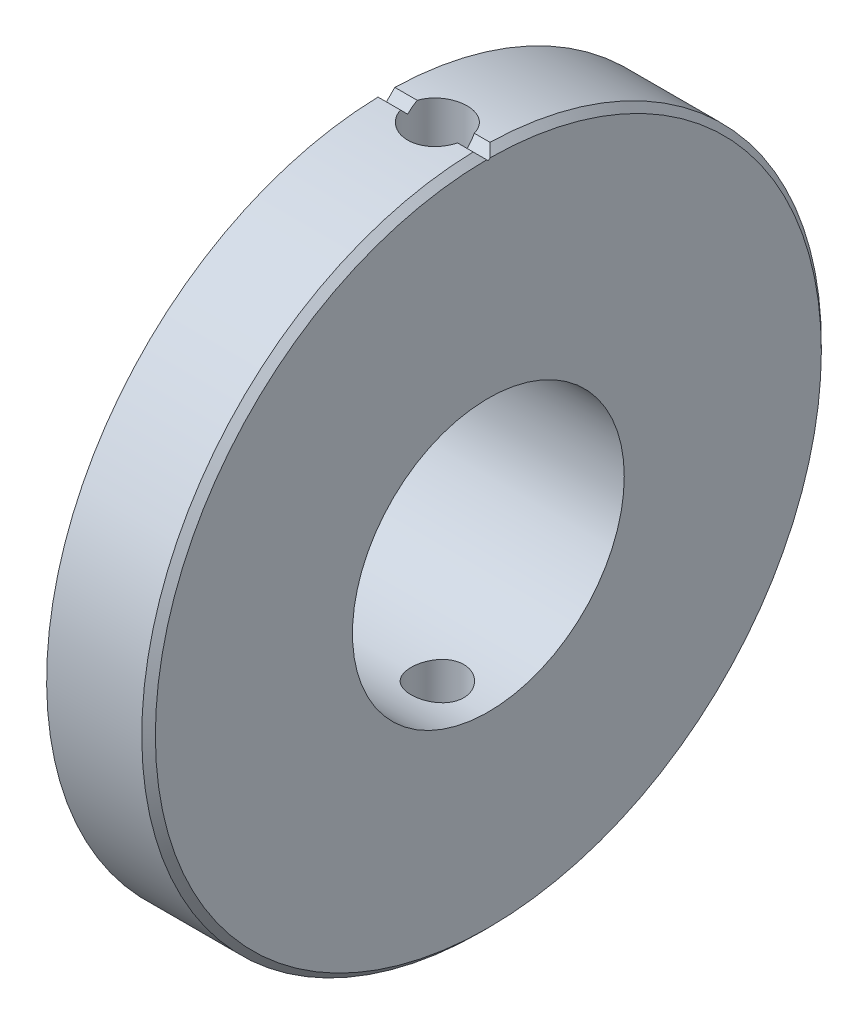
ISO-10303-21;
HEADER;
FILE_DESCRIPTION(('STEP AP214'),'2;1');
FILE_NAME('part.step','',(''),(''),'','','');
FILE_SCHEMA(('AUTOMOTIVE_DESIGN { 1 0 10303 214 1 1 1 1 }'));
ENDSEC;
DATA;
#1=APPLICATION_CONTEXT('core data for automotive mechanical design processes');
#2=APPLICATION_PROTOCOL_DEFINITION('international standard','automotive_design',2000,#1);
#3=PRODUCT_CONTEXT('',#1,'mechanical');
#4=PRODUCT('Part','Part','',(#3));
#5=PRODUCT_RELATED_PRODUCT_CATEGORY('part','',(#4));
#6=PRODUCT_DEFINITION_FORMATION('','',#4);
#7=PRODUCT_DEFINITION_CONTEXT('part definition',#1,'design');
#8=PRODUCT_DEFINITION('design','',#6,#7);
#9=PRODUCT_DEFINITION_SHAPE('','',#8);
#10=(LENGTH_UNIT() NAMED_UNIT(*) SI_UNIT(.MILLI.,.METRE.));
#11=(NAMED_UNIT(*) PLANE_ANGLE_UNIT() SI_UNIT($,.RADIAN.));
#12=(NAMED_UNIT(*) SI_UNIT($,.STERADIAN.) SOLID_ANGLE_UNIT());
#13=UNCERTAINTY_MEASURE_WITH_UNIT(LENGTH_MEASURE(1.E-05),#10,'distance_accuracy_value','');
#14=(GEOMETRIC_REPRESENTATION_CONTEXT(3) GLOBAL_UNCERTAINTY_ASSIGNED_CONTEXT((#13)) GLOBAL_UNIT_ASSIGNED_CONTEXT((#10,
#11,#12)) REPRESENTATION_CONTEXT('',''));
#15=CARTESIAN_POINT('',(0.,0.,0.));
#16=DIRECTION('',(0.,0.,1.));
#17=DIRECTION('',(1.,0.,0.));
#18=AXIS2_PLACEMENT_3D('',#15,#16,#17);
#19=CARTESIAN_POINT('',(0.,0.,0.));
#20=DIRECTION('',(-1.,0.,0.));
#21=DIRECTION('',(0.,0.,1.));
#22=AXIS2_PLACEMENT_3D('',#19,#20,#21);
#23=CYLINDRICAL_SURFACE('',#22,20.);
#24=CARTESIAN_POINT('',(7.95,-20.,0.));
#25=CARTESIAN_POINT('',(7.95000380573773,-19.9999992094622,0.0869242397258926));
#26=CARTESIAN_POINT('',(7.95733667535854,-19.9994272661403,0.173908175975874));
#27=CARTESIAN_POINT('',(7.98648181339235,-19.9972006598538,0.345470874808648));
#28=CARTESIAN_POINT('',(8.00831062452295,-19.9955447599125,0.430046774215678));
#29=CARTESIAN_POINT('',(8.06581393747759,-19.9913374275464,0.594283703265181));
#30=CARTESIAN_POINT('',(8.10148076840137,-19.9887864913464,0.673947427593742));
#31=CARTESIAN_POINT('',(8.1856343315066,-19.9830754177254,0.826137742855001));
#32=CARTESIAN_POINT('',(8.23411826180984,-19.9799154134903,0.898665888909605));
#33=CARTESIAN_POINT('',(8.34264660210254,-19.9733331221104,1.03470720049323));
#34=CARTESIAN_POINT('',(8.40271360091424,-19.9699103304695,1.09820232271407));
#35=CARTESIAN_POINT('',(8.53265551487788,-19.9631924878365,1.21422050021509));
#36=CARTESIAN_POINT('',(8.60253085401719,-19.9598974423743,1.26674308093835));
#37=CARTESIAN_POINT('',(8.75021357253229,-19.9538025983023,1.35938507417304));
#38=CARTESIAN_POINT('',(8.82803080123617,-19.9510034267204,1.39948883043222));
#39=CARTESIAN_POINT('',(8.98931959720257,-19.9462227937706,1.46605473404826));
#40=CARTESIAN_POINT('',(9.07279107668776,-19.9442413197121,1.49251709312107));
#41=CARTESIAN_POINT('',(9.24283967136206,-19.9413245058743,1.5309972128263));
#42=CARTESIAN_POINT('',(9.32941015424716,-19.9403870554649,1.54304411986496));
#43=CARTESIAN_POINT('',(9.50334913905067,-19.939657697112,1.55244139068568));
#44=CARTESIAN_POINT('',(9.59071762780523,-19.9398657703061,1.54979199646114));
#45=CARTESIAN_POINT('',(9.76357316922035,-19.9414020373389,1.5298959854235));
#46=CARTESIAN_POINT('',(9.84906388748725,-19.942727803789,1.51268100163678));
#47=CARTESIAN_POINT('',(10.0159387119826,-19.9463462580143,1.46419160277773));
#48=CARTESIAN_POINT('',(10.0973227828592,-19.9486389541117,1.43291706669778));
#49=CARTESIAN_POINT('',(10.2537751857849,-19.9539357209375,1.35716076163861));
#50=CARTESIAN_POINT('',(10.3288365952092,-19.9569405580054,1.31266475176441));
#51=CARTESIAN_POINT('',(10.4704372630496,-19.9633222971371,1.21173885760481));
#52=CARTESIAN_POINT('',(10.5369763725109,-19.9666992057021,1.15530876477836));
#53=CARTESIAN_POINT('',(10.659827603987,-19.9734553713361,1.03193889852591));
#54=CARTESIAN_POINT('',(10.7161122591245,-19.9768346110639,0.964971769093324));
#55=CARTESIAN_POINT('',(10.8166446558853,-19.9832061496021,0.822524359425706));
#56=CARTESIAN_POINT('',(10.8608923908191,-19.9861984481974,0.747044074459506));
#57=CARTESIAN_POINT('',(10.9360930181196,-19.9914594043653,0.589695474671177));
#58=CARTESIAN_POINT('',(10.9670447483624,-19.9937279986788,0.507826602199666));
#59=CARTESIAN_POINT('',(11.0147558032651,-19.9972851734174,0.340032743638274));
#60=CARTESIAN_POINT('',(11.0315153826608,-19.9985737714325,0.254107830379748));
#61=CARTESIAN_POINT('',(11.0503320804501,-20.000023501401,0.0808791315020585));
#62=CARTESIAN_POINT('',(11.0524271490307,-20.000187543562,-0.00642050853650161));
#63=CARTESIAN_POINT('',(11.0419546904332,-19.9993774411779,-0.18012983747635));
#64=CARTESIAN_POINT('',(11.0293872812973,-19.9984033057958,-0.266539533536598));
#65=CARTESIAN_POINT('',(10.9899780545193,-19.9954283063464,-0.435908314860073));
#66=CARTESIAN_POINT('',(10.9631537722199,-19.9934287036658,-0.518871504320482));
#67=CARTESIAN_POINT('',(10.8960101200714,-19.9886274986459,-0.679119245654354));
#68=CARTESIAN_POINT('',(10.8556905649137,-19.9858258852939,-0.756403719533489));
#69=CARTESIAN_POINT('',(10.7626051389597,-19.9797276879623,-0.903273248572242));
#70=CARTESIAN_POINT('',(10.7098140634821,-19.9764301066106,-0.972842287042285));
#71=CARTESIAN_POINT('',(10.5933206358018,-19.9697140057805,-1.10214459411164));
#72=CARTESIAN_POINT('',(10.5296181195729,-19.9662954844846,-1.16187771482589));
#73=CARTESIAN_POINT('',(10.3929456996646,-19.9597142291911,-1.26994226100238));
#74=CARTESIAN_POINT('',(10.3199562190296,-19.9565520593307,-1.31824896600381));
#75=CARTESIAN_POINT('',(10.1668795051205,-19.9508492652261,-1.40192005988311));
#76=CARTESIAN_POINT('',(10.0867923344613,-19.9483086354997,-1.43728456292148));
#77=CARTESIAN_POINT('',(9.92188200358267,-19.9441395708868,-1.49402505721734));
#78=CARTESIAN_POINT('',(9.83706412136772,-19.9425101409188,-1.51541631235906));
#79=CARTESIAN_POINT('',(9.66502744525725,-19.9403445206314,-1.54365283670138));
#80=CARTESIAN_POINT('',(9.57780869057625,-19.9398083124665,-1.55049834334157));
#81=CARTESIAN_POINT('',(9.40369178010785,-19.9398900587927,-1.54944646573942));
#82=CARTESIAN_POINT('',(9.31679338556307,-19.9405049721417,-1.54158792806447));
#83=CARTESIAN_POINT('',(9.14555436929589,-19.9428132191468,-1.51143189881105));
#84=CARTESIAN_POINT('',(9.06121375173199,-19.9445065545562,-1.48913438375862));
#85=CARTESIAN_POINT('',(8.89748093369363,-19.9487800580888,-1.43074288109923));
#86=CARTESIAN_POINT('',(8.81808853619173,-19.9513601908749,-1.39464944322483));
#87=CARTESIAN_POINT('',(8.66648413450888,-19.9571166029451,-1.30969521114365));
#88=CARTESIAN_POINT('',(8.59427199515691,-19.9602928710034,-1.26083465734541));
#89=CARTESIAN_POINT('',(8.45887945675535,-19.9668935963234,-1.15158752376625));
#90=CARTESIAN_POINT('',(8.39572219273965,-19.9703186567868,-1.09117230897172));
#91=CARTESIAN_POINT('',(8.2804206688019,-19.9770255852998,-0.960580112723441));
#92=CARTESIAN_POINT('',(8.22827908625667,-19.9803074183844,-0.890400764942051));
#93=CARTESIAN_POINT('',(8.13642904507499,-19.9863632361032,-0.742154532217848));
#94=CARTESIAN_POINT('',(8.09674143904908,-19.9891363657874,-0.664074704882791));
#95=CARTESIAN_POINT('',(8.03108962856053,-19.9938519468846,-0.502392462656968));
#96=CARTESIAN_POINT('',(8.00510955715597,-19.9957953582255,-0.418796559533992));
#97=CARTESIAN_POINT('',(7.97426898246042,-19.9981304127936,-0.278918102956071));
#98=CARTESIAN_POINT('',(7.96518010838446,-19.9988283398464,-0.223536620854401));
#99=CARTESIAN_POINT('',(7.95304439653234,-19.999763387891,-0.112111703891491));
#100=CARTESIAN_POINT('',(7.94999754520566,-20.0000005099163,-0.0560682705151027));
#101=CARTESIAN_POINT('',(7.95,-20.,0.));
#102=B_SPLINE_CURVE_WITH_KNOTS('',3,(#24,#25,#26,#27,#28,#29,#30,#31,#32,#33,#34,#35,#36,#37,
#38,#39,#40,#41,#42,#43,#44,#45,#46,#47,#48,#49,#50,#51,#52,#53,#54,#55,#56,#57,#58,#59,#60,#61,
#62,#63,#64,#65,#66,#67,#68,#69,#70,#71,#72,#73,#74,#75,#76,#77,#78,#79,#80,#81,#82,#83,#84,#85,
#86,#87,#88,#89,#90,#91,#92,#93,#94,#95,#96,#97,#98,#99,#100,#101),.UNSPECIFIED.,.T.,.F.,(4,2,2,
2,2,2,2,2,2,2,2,2,2,2,2,2,2,2,2,2,2,2,2,2,2,2,2,2,2,2,2,2,2,2,2,2,2,2,4),(0.,0.260568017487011,
0.521433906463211,0.782155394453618,1.04281993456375,1.30399804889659,1.56518745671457,
1.82670481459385,2.0882181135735,2.34920176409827,2.61018111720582,2.87059513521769,
3.1310113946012,3.39170917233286,3.65241150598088,3.91380218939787,4.17519301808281,
4.43660668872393,4.69801566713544,4.95874789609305,5.21947802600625,5.47988820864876,
5.74030196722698,6.00124658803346,6.26219513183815,6.52370316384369,6.78520888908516,
7.04642847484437,7.30764379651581,7.56816998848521,7.82869660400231,8.08921283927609,
8.34972416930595,8.61088967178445,8.87211857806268,9.13378257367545,9.39514301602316,
9.56321616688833,9.73128894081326),.UNSPECIFIED.);
#103=CARTESIAN_POINT('',(7.95,-20.,0.));
#104=VERTEX_POINT('',#103);
#105=EDGE_CURVE('E175',#104,#104,#102,.T.);
#106=ORIENTED_EDGE('',*,*,#105,.T.);
#107=EDGE_LOOP('',(#106));
#108=FACE_BOUND('',#107,.T.);
#109=CARTESIAN_POINT('',(7.82114259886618,19.9939006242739,0.493900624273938));
#110=CARTESIAN_POINT('',(7.83504226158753,19.9927343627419,0.541147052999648));
#111=CARTESIAN_POINT('',(7.85092923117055,19.9914138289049,0.587780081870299));
#112=CARTESIAN_POINT('',(7.88656887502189,19.9885051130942,0.679532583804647));
#113=CARTESIAN_POINT('',(7.90632129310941,19.9869169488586,0.724652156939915));
#114=CARTESIAN_POINT('',(7.97114490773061,19.9818177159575,0.857173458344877));
#115=CARTESIAN_POINT('',(8.0218292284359,19.9779677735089,0.941896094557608));
#116=CARTESIAN_POINT('',(8.13667652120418,19.9697992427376,1.1016083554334));
#117=CARTESIAN_POINT('',(8.20084467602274,19.9654804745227,1.17659421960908));
#118=CARTESIAN_POINT('',(8.34084915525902,19.9568600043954,1.3147369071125));
#119=CARTESIAN_POINT('',(8.41668358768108,19.9525582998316,1.37789564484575));
#120=CARTESIAN_POINT('',(8.57800660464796,19.9444499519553,1.49068111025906));
#121=CARTESIAN_POINT('',(8.66350872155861,19.9406440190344,1.54028852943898));
#122=CARTESIAN_POINT('',(8.84167814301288,19.9339652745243,1.62444426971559));
#123=CARTESIAN_POINT('',(8.93434637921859,19.9310925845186,1.65899062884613));
#124=CARTESIAN_POINT('',(9.12399970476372,19.9266132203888,1.71195700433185));
#125=CARTESIAN_POINT('',(9.22097520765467,19.9250038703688,1.73041111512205));
#126=CARTESIAN_POINT('',(9.41665337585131,19.923224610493,1.75077933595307));
#127=CARTESIAN_POINT('',(9.51535588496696,19.9230545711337,1.75269493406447));
#128=CARTESIAN_POINT('',(9.7113687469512,19.92417122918,1.73995392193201));
#129=CARTESIAN_POINT('',(9.80868246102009,19.9254534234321,1.72534854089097));
#130=CARTESIAN_POINT('',(9.99947292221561,19.9293218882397,1.68007138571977));
#131=CARTESIAN_POINT('',(10.092949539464,19.9319082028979,1.64939906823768));
#132=CARTESIAN_POINT('',(10.2734884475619,19.9380949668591,1.57284351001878));
#133=CARTESIAN_POINT('',(10.3605463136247,19.9416961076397,1.52694989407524));
#134=CARTESIAN_POINT('',(10.52574514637,19.9495071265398,1.42125371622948));
#135=CARTESIAN_POINT('',(10.6038853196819,19.9537170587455,1.36144991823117));
#136=CARTESIAN_POINT('',(10.7493230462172,19.9622896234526,1.22938210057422));
#137=CARTESIAN_POINT('',(10.8165792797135,19.9666527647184,1.15707265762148));
#138=CARTESIAN_POINT('',(10.937980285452,19.9750246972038,1.00218684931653));
#139=CARTESIAN_POINT('',(10.9921331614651,19.9790337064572,0.919616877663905));
#140=CARTESIAN_POINT('',(11.0681510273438,19.9848879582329,0.779212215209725));
#141=CARTESIAN_POINT('',(11.0944972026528,19.9869796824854,0.723764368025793));
#142=CARTESIAN_POINT('',(11.1412043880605,19.9907611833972,0.610490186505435));
#143=CARTESIAN_POINT('',(11.1615745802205,19.9924515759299,0.552667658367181));
#144=CARTESIAN_POINT('',(11.1788574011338,19.9939006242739,0.493900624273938));
#145=B_SPLINE_CURVE_WITH_KNOTS('',3,(#109,#110,#111,#112,#113,#114,#115,#116,#117,#118,#119,
#120,#121,#122,#123,#124,#125,#126,#127,#128,#129,#130,#131,#132,#133,#134,#135,#136,#137,#138,
#139,#140,#141,#142,#143,#144),.UNSPECIFIED.,.F.,.F.,(4,2,2,2,2,2,2,2,2,2,2,2,2,2,2,2,2,4),(0.,
0.147695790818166,0.295381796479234,0.590264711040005,0.885261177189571,1.18020985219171,
1.4755766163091,1.77098184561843,2.06575967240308,2.36051097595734,2.65435079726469,
2.94820055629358,3.24225102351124,3.53632763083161,3.83149572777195,4.12648080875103,
4.3104418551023,4.49411874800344),.UNSPECIFIED.);
#146=CARTESIAN_POINT('',(7.82114259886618,19.9939006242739,0.493900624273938));
#147=VERTEX_POINT('',#146);
#148=CARTESIAN_POINT('',(11.1788574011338,19.9939006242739,0.493900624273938));
#149=VERTEX_POINT('',#148);
#150=EDGE_CURVE('E87',#147,#149,#145,.T.);
#151=ORIENTED_EDGE('',*,*,#150,.F.);
#152=DIRECTION('',(-1.,0.,0.));
#153=VECTOR('',#152,1.);
#154=CARTESIAN_POINT('',(0.,19.9939006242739,0.493900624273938));
#155=LINE('',#154,#153);
#156=CARTESIAN_POINT('',(6.5,19.9939006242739,0.493900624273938));
#157=VERTEX_POINT('',#156);
#158=EDGE_CURVE('E95',#147,#157,#155,.T.);
#159=ORIENTED_EDGE('',*,*,#158,.T.);
#160=CARTESIAN_POINT('',(6.5,0.,0.));
#161=DIRECTION('',(-1.,0.,0.));
#162=DIRECTION('',(0.,0.,1.));
#163=AXIS2_PLACEMENT_3D('',#160,#161,#162);
#164=CIRCLE('',#163,20.);
#165=CARTESIAN_POINT('',(6.5,19.9939006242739,-0.493900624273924));
#166=VERTEX_POINT('',#165);
#167=EDGE_CURVE('E308',#166,#157,#164,.T.);
#168=ORIENTED_EDGE('',*,*,#167,.F.);
#169=DIRECTION('',(-1.,0.,0.));
#170=VECTOR('',#169,1.);
#171=CARTESIAN_POINT('',(0.,19.9939006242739,-0.493900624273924));
#172=LINE('',#171,#170);
#173=CARTESIAN_POINT('',(7.82114259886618,19.9939006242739,-0.493900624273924));
#174=VERTEX_POINT('',#173);
#175=EDGE_CURVE('E107',#166,#174,#172,.F.);
#176=ORIENTED_EDGE('',*,*,#175,.T.);
#177=CARTESIAN_POINT('',(11.1788574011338,19.9939006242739,-0.493900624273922));
#178=CARTESIAN_POINT('',(11.1649577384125,19.9927343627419,-0.541147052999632));
#179=CARTESIAN_POINT('',(11.1490707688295,19.9914138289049,-0.587780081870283));
#180=CARTESIAN_POINT('',(11.1134311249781,19.9885051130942,-0.679532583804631));
#181=CARTESIAN_POINT('',(11.0936787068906,19.9869169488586,-0.7246521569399));
#182=CARTESIAN_POINT('',(11.0288550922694,19.9818177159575,-0.857173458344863));
#183=CARTESIAN_POINT('',(10.9781707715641,19.9779677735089,-0.941896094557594));
#184=CARTESIAN_POINT('',(10.8633234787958,19.9697992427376,-1.10160835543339));
#185=CARTESIAN_POINT('',(10.7991553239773,19.9654804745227,-1.17659421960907));
#186=CARTESIAN_POINT('',(10.659150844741,19.9568600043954,-1.31473690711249));
#187=CARTESIAN_POINT('',(10.5833164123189,19.9525582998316,-1.37789564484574));
#188=CARTESIAN_POINT('',(10.421993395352,19.9444499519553,-1.49068111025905));
#189=CARTESIAN_POINT('',(10.3364912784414,19.9406440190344,-1.54028852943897));
#190=CARTESIAN_POINT('',(10.1583218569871,19.9339652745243,-1.62444426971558));
#191=CARTESIAN_POINT('',(10.0656536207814,19.9310925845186,-1.65899062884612));
#192=CARTESIAN_POINT('',(9.8760002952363,19.9266132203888,-1.71195700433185));
#193=CARTESIAN_POINT('',(9.77902479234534,19.9250038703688,-1.73041111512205));
#194=CARTESIAN_POINT('',(9.58334662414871,19.923224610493,-1.75077933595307));
#195=CARTESIAN_POINT('',(9.48464411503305,19.9230545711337,-1.75269493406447));
#196=CARTESIAN_POINT('',(9.28863125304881,19.92417122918,-1.73995392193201));
#197=CARTESIAN_POINT('',(9.19131753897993,19.9254534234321,-1.72534854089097));
#198=CARTESIAN_POINT('',(9.0005270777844,19.9293218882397,-1.68007138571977));
#199=CARTESIAN_POINT('',(8.90705046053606,19.9319082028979,-1.64939906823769));
#200=CARTESIAN_POINT('',(8.72651155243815,19.9380949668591,-1.57284351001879));
#201=CARTESIAN_POINT('',(8.63945368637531,19.9416961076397,-1.52694989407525));
#202=CARTESIAN_POINT('',(8.47425485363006,19.9495071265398,-1.42125371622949));
#203=CARTESIAN_POINT('',(8.39611468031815,19.9537170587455,-1.36144991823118));
#204=CARTESIAN_POINT('',(8.25067695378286,19.9622896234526,-1.22938210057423));
#205=CARTESIAN_POINT('',(8.18342072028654,19.9666527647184,-1.1570726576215));
#206=CARTESIAN_POINT('',(8.06201971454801,19.9750246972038,-1.00218684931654));
#207=CARTESIAN_POINT('',(8.00786683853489,19.9790337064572,-0.91961687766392));
#208=CARTESIAN_POINT('',(7.93184897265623,19.9848879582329,-0.779212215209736));
#209=CARTESIAN_POINT('',(7.90550279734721,19.9869796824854,-0.723764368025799));
#210=CARTESIAN_POINT('',(7.85879561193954,19.9907611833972,-0.610490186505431));
#211=CARTESIAN_POINT('',(7.83842541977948,19.9924515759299,-0.552667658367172));
#212=CARTESIAN_POINT('',(7.82114259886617,19.9939006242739,-0.493900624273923));
#213=B_SPLINE_CURVE_WITH_KNOTS('',3,(#177,#178,#179,#180,#181,#182,#183,#184,#185,#186,#187,
#188,#189,#190,#191,#192,#193,#194,#195,#196,#197,#198,#199,#200,#201,#202,#203,#204,#205,#206,
#207,#208,#209,#210,#211,#212),.UNSPECIFIED.,.F.,.F.,(4,2,2,2,2,2,2,2,2,2,2,2,2,2,2,2,2,4),(0.,
0.147695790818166,0.295381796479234,0.590264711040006,0.885261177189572,1.18020985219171,
1.4755766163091,1.77098184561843,2.06575967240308,2.36051097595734,2.65435079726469,
2.94820055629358,3.24225102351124,3.53632763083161,3.83149572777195,4.12648080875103,
4.31044185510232,4.49411874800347),.UNSPECIFIED.);
#214=CARTESIAN_POINT('',(11.1788574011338,19.9939006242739,-0.493900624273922));
#215=VERTEX_POINT('',#214);
#216=EDGE_CURVE('E99',#215,#174,#213,.T.);
#217=ORIENTED_EDGE('',*,*,#216,.F.);
#218=CARTESIAN_POINT('',(12.1,19.9939006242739,-0.493900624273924));
#219=VERTEX_POINT('',#218);
#220=EDGE_CURVE('E50',#215,#219,#172,.F.);
#221=ORIENTED_EDGE('',*,*,#220,.T.);
#222=CARTESIAN_POINT('',(12.1,0.,0.));
#223=DIRECTION('',(-1.,0.,0.));
#224=DIRECTION('',(0.,0.,1.));
#225=AXIS2_PLACEMENT_3D('',#222,#223,#224);
#226=CIRCLE('',#225,20.);
#227=CARTESIAN_POINT('',(12.1,19.9939006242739,0.493900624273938));
#228=VERTEX_POINT('',#227);
#229=EDGE_CURVE('E305',#219,#228,#226,.T.);
#230=ORIENTED_EDGE('',*,*,#229,.T.);
#231=EDGE_CURVE('E97',#228,#149,#155,.T.);
#232=ORIENTED_EDGE('',*,*,#231,.T.);
#233=EDGE_LOOP('',(#151,#159,#168,#176,#217,#221,#230,#232));
#234=FACE_BOUND('',#233,.T.);
#235=ADVANCED_FACE('F27',(#108,#234),#23,.T.);
#236=CARTESIAN_POINT('',(9.5,-20.,0.));
#237=DIRECTION('',(0.,1.,0.));
#238=DIRECTION('',(0.,0.,1.));
#239=AXIS2_PLACEMENT_3D('',#236,#237,#238);
#240=CYLINDRICAL_SURFACE('',#239,1.55);
#241=CARTESIAN_POINT('',(9.5,7.24840748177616,1.55));
#242=CARTESIAN_POINT('',(9.58618289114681,7.24840917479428,1.549996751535));
#243=CARTESIAN_POINT('',(9.67240731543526,7.24984246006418,1.54278770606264));
#244=CARTESIAN_POINT('',(9.84242094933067,7.25541296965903,1.51416369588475));
#245=CARTESIAN_POINT('',(9.92620809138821,7.25955242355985,1.49273701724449));
#246=CARTESIAN_POINT('',(10.0888627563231,7.27004925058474,1.43636372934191));
#247=CARTESIAN_POINT('',(10.1677349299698,7.276404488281,1.40143013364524));
#248=CARTESIAN_POINT('',(10.3184954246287,7.29061427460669,1.31906969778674));
#249=CARTESIAN_POINT('',(10.3903842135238,7.29846872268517,1.27164369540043));
#250=CARTESIAN_POINT('',(10.5260964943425,7.31490844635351,1.16497337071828));
#251=CARTESIAN_POINT('',(10.5898137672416,7.32350130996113,1.10559505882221));
#252=CARTESIAN_POINT('',(10.7064479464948,7.3403827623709,0.976995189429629));
#253=CARTESIAN_POINT('',(10.7593641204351,7.34867133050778,0.907772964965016));
#254=CARTESIAN_POINT('',(10.8533035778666,7.36409185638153,0.760749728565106));
#255=CARTESIAN_POINT('',(10.8942263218,7.3712138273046,0.68288334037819));
#256=CARTESIAN_POINT('',(10.9623690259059,7.38341362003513,0.521219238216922));
#257=CARTESIAN_POINT('',(10.9895901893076,7.38849162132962,0.437422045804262));
#258=CARTESIAN_POINT('',(11.0292274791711,7.39597772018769,0.267376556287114));
#259=CARTESIAN_POINT('',(11.041822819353,7.39841811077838,0.181171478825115));
#260=CARTESIAN_POINT('',(11.0524096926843,7.40046543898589,0.007839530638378));
#261=CARTESIAN_POINT('',(11.0504025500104,7.40007263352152,-0.079287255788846));
#262=CARTESIAN_POINT('',(11.0319781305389,7.39652295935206,-0.250759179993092));
#263=CARTESIAN_POINT('',(11.0157538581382,7.39340311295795,-0.335125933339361));
#264=CARTESIAN_POINT('',(10.969661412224,7.38479153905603,-0.499916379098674));
#265=CARTESIAN_POINT('',(10.939792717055,7.3792997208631,-0.580339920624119));
#266=CARTESIAN_POINT('',(10.8670779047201,7.36649981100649,-0.735516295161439));
#267=CARTESIAN_POINT('',(10.8241553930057,7.35918107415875,-0.810232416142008));
#268=CARTESIAN_POINT('',(10.7266077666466,7.34353544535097,-0.951473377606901));
#269=CARTESIAN_POINT('',(10.6719813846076,7.33520844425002,-1.01799732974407));
#270=CARTESIAN_POINT('',(10.5515154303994,7.318306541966,-1.14211004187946));
#271=CARTESIAN_POINT('',(10.4855069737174,7.3097298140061,-1.19953474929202));
#272=CARTESIAN_POINT('',(10.3447111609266,7.29342488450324,-1.30252471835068));
#273=CARTESIAN_POINT('',(10.2699236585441,7.28569669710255,-1.34808978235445));
#274=CARTESIAN_POINT('',(10.1134662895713,7.27196073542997,-1.42611862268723));
#275=CARTESIAN_POINT('',(10.0317835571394,7.26595627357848,-1.45855722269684));
#276=CARTESIAN_POINT('',(9.86398435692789,7.25639724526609,-1.5092028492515));
#277=CARTESIAN_POINT('',(9.77786842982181,7.25284238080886,-1.5274116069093));
#278=CARTESIAN_POINT('',(9.60513040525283,7.24864436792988,-1.54883836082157));
#279=CARTESIAN_POINT('',(9.51853870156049,7.24795532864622,-1.55229264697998));
#280=CARTESIAN_POINT('',(9.34601609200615,7.24944399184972,-1.5447470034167));
#281=CARTESIAN_POINT('',(9.26008515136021,7.25162154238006,-1.53374783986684));
#282=CARTESIAN_POINT('',(9.09210870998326,7.25855517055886,-1.49781079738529));
#283=CARTESIAN_POINT('',(9.01003541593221,7.2632881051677,-1.47299796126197));
#284=CARTESIAN_POINT('',(8.85121108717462,7.27477910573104,-1.4102710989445));
#285=CARTESIAN_POINT('',(8.77446046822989,7.28153732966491,-1.37235605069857));
#286=CARTESIAN_POINT('',(8.62742264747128,7.29642123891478,-1.28396161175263));
#287=CARTESIAN_POINT('',(8.55722638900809,7.30456269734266,-1.23333365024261));
#288=CARTESIAN_POINT('',(8.42623995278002,7.32125191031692,-1.12114973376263));
#289=CARTESIAN_POINT('',(8.3654506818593,7.32979970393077,-1.05959272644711));
#290=CARTESIAN_POINT('',(8.25411457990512,7.34648666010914,-0.926240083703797));
#291=CARTESIAN_POINT('',(8.20372708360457,7.3546182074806,-0.854310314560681));
#292=CARTESIAN_POINT('',(8.11575213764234,7.36942624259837,-0.702869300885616));
#293=CARTESIAN_POINT('',(8.07816417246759,7.37610278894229,-0.623358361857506));
#294=CARTESIAN_POINT('',(8.01709070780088,7.3872159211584,-0.459441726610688));
#295=CARTESIAN_POINT('',(7.99352859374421,7.39166465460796,-0.37506543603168));
#296=CARTESIAN_POINT('',(7.96093200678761,7.39787286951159,-0.203458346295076));
#297=CARTESIAN_POINT('',(7.95189589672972,7.39963265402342,-0.11622786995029));
#298=CARTESIAN_POINT('',(7.9486679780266,7.40025810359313,0.0570864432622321));
#299=CARTESIAN_POINT('',(7.9542360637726,7.39917058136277,0.143165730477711));
#300=CARTESIAN_POINT('',(7.9795305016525,7.39432145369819,0.313137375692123));
#301=CARTESIAN_POINT('',(7.9992566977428,7.39055987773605,0.397029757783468));
#302=CARTESIAN_POINT('',(8.05220346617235,7.38078593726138,0.560108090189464));
#303=CARTESIAN_POINT('',(8.08539685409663,7.37477810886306,0.639303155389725));
#304=CARTESIAN_POINT('',(8.16430623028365,7.36116030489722,0.791034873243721));
#305=CARTESIAN_POINT('',(8.21002313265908,7.35355021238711,0.863571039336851));
#306=CARTESIAN_POINT('',(8.3135001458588,7.3374200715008,1.00111787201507));
#307=CARTESIAN_POINT('',(8.37143289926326,7.32888794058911,1.06599725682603));
#308=CARTESIAN_POINT('',(8.49734057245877,7.31194936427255,1.18519653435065));
#309=CARTESIAN_POINT('',(8.56531785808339,7.30354294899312,1.23951393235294));
#310=CARTESIAN_POINT('',(8.71019870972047,7.28771547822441,1.33656014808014));
#311=CARTESIAN_POINT('',(8.78718467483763,7.2803051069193,1.37916775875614));
#312=CARTESIAN_POINT('',(8.94734298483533,7.26743823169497,1.45077566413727));
#313=CARTESIAN_POINT('',(9.03050951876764,7.26197991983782,1.47978855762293));
#314=CARTESIAN_POINT('',(9.17824486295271,7.25474947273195,1.51761979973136));
#315=CARTESIAN_POINT('',(9.24195946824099,7.2523856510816,1.52974111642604));
#316=CARTESIAN_POINT('',(9.37044157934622,7.24921404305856,1.54593231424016));
#317=CARTESIAN_POINT('',(9.43520905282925,7.24840620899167,1.55000244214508));
#318=CARTESIAN_POINT('',(9.5,7.24840748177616,1.55));
#319=B_SPLINE_CURVE_WITH_KNOTS('',3,(#241,#242,#243,#244,#245,#246,#247,#248,#249,#250,#251,
#252,#253,#254,#255,#256,#257,#258,#259,#260,#261,#262,#263,#264,#265,#266,#267,#268,#269,#270,
#271,#272,#273,#274,#275,#276,#277,#278,#279,#280,#281,#282,#283,#284,#285,#286,#287,#288,#289,
#290,#291,#292,#293,#294,#295,#296,#297,#298,#299,#300,#301,#302,#303,#304,#305,#306,#307,#308,
#309,#310,#311,#312,#313,#314,#315,#316,#317,#318),.UNSPECIFIED.,.T.,.F.,(4,2,2,2,2,2,2,2,2,2,2,
2,2,2,2,2,2,2,2,2,2,2,2,2,2,2,2,2,2,2,2,2,2,2,2,2,2,2,4),(0.,0.25831150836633,0.516836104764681,
0.775112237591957,1.03337105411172,1.29470478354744,1.55605622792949,1.81953968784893,
2.08300000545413,2.34319683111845,2.60337006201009,2.86006509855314,3.1167699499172,
3.37500700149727,3.63327203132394,3.89576385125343,4.15826004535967,4.42125734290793,
4.68422264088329,4.9429604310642,5.20168450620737,5.45810379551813,5.71454309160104,
5.97413142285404,6.23374476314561,6.4970800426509,6.76040471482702,7.02227748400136,
7.28412073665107,7.54168614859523,7.79924872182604,8.05629395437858,8.31335795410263,
8.57433290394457,8.83536942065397,9.09901402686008,9.36241381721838,9.5566143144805,
9.75080885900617),.UNSPECIFIED.);
#320=CARTESIAN_POINT('',(9.5,7.24840748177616,1.55));
#321=VERTEX_POINT('',#320);
#322=EDGE_CURVE('E173',#321,#321,#319,.T.);
#323=ORIENTED_EDGE('',*,*,#322,.F.);
#324=EDGE_LOOP('',(#323));
#325=FACE_BOUND('',#324,.T.);
#326=CARTESIAN_POINT('',(9.5,10.,0.));
#327=DIRECTION('',(0.,1.,0.));
#328=DIRECTION('',(0.,0.,1.));
#329=AXIS2_PLACEMENT_3D('',#326,#327,#328);
#330=CIRCLE('',#329,1.55);
#331=CARTESIAN_POINT('',(9.5,10.,1.55));
#332=VERTEX_POINT('',#331);
#333=EDGE_CURVE('E31',#332,#332,#330,.F.);
#334=ORIENTED_EDGE('',*,*,#333,.F.);
#335=EDGE_LOOP('',(#334));
#336=FACE_BOUND('',#335,.T.);
#337=ADVANCED_FACE('F147',(#325,#336),#240,.F.);
#338=CARTESIAN_POINT('',(0.,19.5,0.));
#339=DIRECTION('',(0.,-0.707106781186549,0.707106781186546));
#340=DIRECTION('',(0.,-0.707106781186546,-0.707106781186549));
#341=AXIS2_PLACEMENT_3D('',#338,#339,#340);
#342=PLANE('',#341);
#343=CARTESIAN_POINT('',(9.5,19.5,0.));
#344=DIRECTION('',(0.,-0.707106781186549,0.707106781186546));
#345=DIRECTION('',(0.,-0.707106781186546,-0.707106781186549));
#346=AXIS2_PLACEMENT_3D('',#343,#344,#345);
#347=ELLIPSE('',#346,2.47487373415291,1.75);
#348=CARTESIAN_POINT('',(11.25,19.5,0.));
#349=VERTEX_POINT('',#348);
#350=EDGE_CURVE('E120',#149,#349,#347,.F.);
#351=ORIENTED_EDGE('',*,*,#350,.F.);
#352=ORIENTED_EDGE('',*,*,#231,.F.);
#353=CARTESIAN_POINT('',(12.0998,19.9940958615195,0.494095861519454));
#354=CARTESIAN_POINT('',(12.1669528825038,19.9285506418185,0.428550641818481));
#355=CARTESIAN_POINT('',(12.2338959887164,19.8628989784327,0.362898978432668));
#356=CARTESIAN_POINT('',(12.3673626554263,19.7313827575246,0.231382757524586));
#357=CARTESIAN_POINT('',(12.4338862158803,19.6655181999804,0.16551819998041));
#358=CARTESIAN_POINT('',(12.5002,19.5995471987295,0.0995471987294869));
#359=B_SPLINE_CURVE_WITH_KNOTS('',3,(#353,#354,#355,#356,#357,#358),.UNSPECIFIED.,.F.,.F.,(4,2,
4),(0.,0.343387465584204,0.686774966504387),.UNSPECIFIED.);
#360=CARTESIAN_POINT('',(12.5,19.5997461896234,0.0997461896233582));
#361=VERTEX_POINT('',#360);
#362=EDGE_CURVE('E105',#228,#361,#359,.T.);
#363=ORIENTED_EDGE('',*,*,#362,.T.);
#364=DIRECTION('',(0.,-0.707106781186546,-0.707106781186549));
#365=VECTOR('',#364,1.);
#366=CARTESIAN_POINT('',(12.5,19.5,0.));
#367=LINE('',#366,#365);
#368=CARTESIAN_POINT('',(12.5,19.5,0.));
#369=VERTEX_POINT('',#368);
#370=EDGE_CURVE('E114',#361,#369,#367,.T.);
#371=ORIENTED_EDGE('',*,*,#370,.T.);
#372=DIRECTION('',(1.,0.,0.));
#373=VECTOR('',#372,1.);
#374=CARTESIAN_POINT('',(0.,19.5,0.));
#375=LINE('',#374,#373);
#376=EDGE_CURVE('E112',#349,#369,#375,.T.);
#377=ORIENTED_EDGE('',*,*,#376,.F.);
#378=EDGE_LOOP('',(#351,#352,#363,#371,#377));
#379=FACE_BOUND('',#378,.T.);
#380=ADVANCED_FACE('F141',(#379),#342,.F.);
#381=CARTESIAN_POINT('',(0.,22.5,-2.99999999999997));
#382=DIRECTION('',(0.,-0.707106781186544,-0.707106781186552));
#383=DIRECTION('',(0.,0.707106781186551,-0.707106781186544));
#384=AXIS2_PLACEMENT_3D('',#381,#382,#383);
#385=PLANE('',#384);
#386=CARTESIAN_POINT('',(9.5,19.5,0.));
#387=DIRECTION('',(0.,-0.707106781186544,-0.707106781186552));
#388=DIRECTION('',(0.,-0.707106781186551,0.707106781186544));
#389=AXIS2_PLACEMENT_3D('',#386,#387,#388);
#390=ELLIPSE('',#389,2.47487373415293,1.75);
#391=EDGE_CURVE('E98',#349,#215,#390,.F.);
#392=ORIENTED_EDGE('',*,*,#391,.F.);
#393=ORIENTED_EDGE('',*,*,#376,.T.);
#394=DIRECTION('',(0.,0.707106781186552,-0.707106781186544));
#395=VECTOR('',#394,1.);
#396=CARTESIAN_POINT('',(12.5,22.5,-2.99999999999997));
#397=LINE('',#396,#395);
#398=CARTESIAN_POINT('',(12.5,19.5997461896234,-0.0997461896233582));
#399=VERTEX_POINT('',#398);
#400=EDGE_CURVE('E118',#369,#399,#397,.T.);
#401=ORIENTED_EDGE('',*,*,#400,.T.);
#402=CARTESIAN_POINT('',(12.5002,19.5995471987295,-0.0995471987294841));
#403=CARTESIAN_POINT('',(12.4338862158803,19.6655181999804,-0.165518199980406));
#404=CARTESIAN_POINT('',(12.3673626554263,19.7313827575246,-0.231382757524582));
#405=CARTESIAN_POINT('',(12.2338959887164,19.8628989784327,-0.362898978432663));
#406=CARTESIAN_POINT('',(12.1669528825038,19.9285506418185,-0.428550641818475));
#407=CARTESIAN_POINT('',(12.0998,19.9940958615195,-0.494095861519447));
#408=B_SPLINE_CURVE_WITH_KNOTS('',3,(#402,#403,#404,#405,#406,#407),.UNSPECIFIED.,.F.,.F.,(4,2,
4),(0.,0.343387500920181,0.686774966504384),.UNSPECIFIED.);
#409=EDGE_CURVE('E167',#399,#219,#408,.T.);
#410=ORIENTED_EDGE('',*,*,#409,.T.);
#411=ORIENTED_EDGE('',*,*,#220,.F.);
#412=EDGE_LOOP('',(#392,#393,#401,#410,#411));
#413=FACE_BOUND('',#412,.T.);
#414=ADVANCED_FACE('F146',(#413),#385,.F.);
#415=CARTESIAN_POINT('',(9.5,19.5,0.));
#416=DIRECTION('',(0.,-0.707106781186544,-0.707106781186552));
#417=DIRECTION('',(0.,-0.707106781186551,0.707106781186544));
#418=AXIS2_PLACEMENT_3D('',#415,#416,#417);
#419=ELLIPSE('',#418,2.47487373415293,1.75);
#420=CARTESIAN_POINT('',(7.75,19.5,0.));
#421=VERTEX_POINT('',#420);
#422=EDGE_CURVE('E42',#174,#421,#419,.F.);
#423=ORIENTED_EDGE('',*,*,#422,.F.);
#424=ORIENTED_EDGE('',*,*,#175,.F.);
#425=DIRECTION('',(0.,0.707106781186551,-0.707106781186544));
#426=VECTOR('',#425,1.);
#427=CARTESIAN_POINT('',(6.5,14.7499999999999,4.75));
#428=LINE('',#427,#426);
#429=CARTESIAN_POINT('',(6.5,19.5,0.));
#430=VERTEX_POINT('',#429);
#431=EDGE_CURVE('E174',#430,#166,#428,.T.);
#432=ORIENTED_EDGE('',*,*,#431,.F.);
#433=EDGE_CURVE('E111',#430,#421,#375,.T.);
#434=ORIENTED_EDGE('',*,*,#433,.T.);
#435=EDGE_LOOP('',(#423,#424,#432,#434));
#436=FACE_BOUND('',#435,.T.);
#437=ADVANCED_FACE('F238',(#436),#385,.F.);
#438=CARTESIAN_POINT('',(9.5,19.5,0.));
#439=DIRECTION('',(0.,-0.707106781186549,0.707106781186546));
#440=DIRECTION('',(0.,-0.707106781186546,-0.707106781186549));
#441=AXIS2_PLACEMENT_3D('',#438,#439,#440);
#442=ELLIPSE('',#441,2.47487373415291,1.75);
#443=EDGE_CURVE('E11',#421,#147,#442,.F.);
#444=ORIENTED_EDGE('',*,*,#443,.F.);
#445=ORIENTED_EDGE('',*,*,#433,.F.);
#446=DIRECTION('',(0.,-0.707106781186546,-0.707106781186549));
#447=VECTOR('',#446,1.);
#448=CARTESIAN_POINT('',(6.5,14.75,-4.75));
#449=LINE('',#448,#447);
#450=EDGE_CURVE('E103',#157,#430,#449,.T.);
#451=ORIENTED_EDGE('',*,*,#450,.F.);
#452=ORIENTED_EDGE('',*,*,#158,.F.);
#453=EDGE_LOOP('',(#444,#445,#451,#452));
#454=FACE_BOUND('',#453,.T.);
#455=ADVANCED_FACE('F101',(#454),#342,.F.);
#456=CARTESIAN_POINT('',(0.,0.,0.));
#457=DIRECTION('',(1.,0.,0.));
#458=DIRECTION('',(0.,0.,-1.));
#459=AXIS2_PLACEMENT_3D('',#456,#457,#458);
#460=PLANE('',#459);
#461=CARTESIAN_POINT('',(0.,-0.6,0.));
#462=DIRECTION('',(1.,0.,0.));
#463=DIRECTION('',(0.,0.,-1.));
#464=AXIS2_PLACEMENT_3D('',#461,#462,#463);
#465=CIRCLE('',#464,8.);
#466=CARTESIAN_POINT('',(0.,-0.6,-8.));
#467=VERTEX_POINT('',#466);
#468=EDGE_CURVE('E296',#467,#467,#465,.T.);
#469=ORIENTED_EDGE('',*,*,#468,.T.);
#470=EDGE_LOOP('',(#469));
#471=FACE_BOUND('',#470,.T.);
#472=CARTESIAN_POINT('',(0.,0.,0.));
#473=DIRECTION('',(1.,0.,0.));
#474=DIRECTION('',(0.,0.,-1.));
#475=AXIS2_PLACEMENT_3D('',#472,#473,#474);
#476=CIRCLE('',#475,9.6);
#477=CARTESIAN_POINT('',(0.,0.,-9.6));
#478=VERTEX_POINT('',#477);
#479=EDGE_CURVE('E299',#478,#478,#476,.F.);
#480=ORIENTED_EDGE('',*,*,#479,.T.);
#481=EDGE_LOOP('',(#480));
#482=FACE_BOUND('',#481,.T.);
#483=ADVANCED_FACE('F29',(#471,#482),#460,.F.);
#484=CARTESIAN_POINT('',(0.,0.,0.));
#485=DIRECTION('',(-1.,0.,0.));
#486=DIRECTION('',(0.,0.,1.));
#487=AXIS2_PLACEMENT_3D('',#484,#485,#486);
#488=CYLINDRICAL_SURFACE('',#487,10.);
#489=CARTESIAN_POINT('',(0.400000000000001,0.,0.));
#490=DIRECTION('',(1.,0.,0.));
#491=DIRECTION('',(0.,0.,-1.));
#492=AXIS2_PLACEMENT_3D('',#489,#490,#491);
#493=CIRCLE('',#492,10.);
#494=CARTESIAN_POINT('',(0.400000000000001,0.,-10.));
#495=VERTEX_POINT('',#494);
#496=EDGE_CURVE('E301',#495,#495,#493,.T.);
#497=ORIENTED_EDGE('',*,*,#496,.T.);
#498=EDGE_LOOP('',(#497));
#499=FACE_BOUND('',#498,.T.);
#500=CARTESIAN_POINT('',(6.5,0.,0.));
#501=DIRECTION('',(-1.,0.,0.));
#502=DIRECTION('',(0.,0.,1.));
#503=AXIS2_PLACEMENT_3D('',#500,#501,#502);
#504=CIRCLE('',#503,10.);
#505=CARTESIAN_POINT('',(6.5,0.,10.));
#506=VERTEX_POINT('',#505);
#507=EDGE_CURVE('E302',#506,#506,#504,.T.);
#508=ORIENTED_EDGE('',*,*,#507,.T.);
#509=EDGE_LOOP('',(#508));
#510=FACE_BOUND('',#509,.T.);
#511=ADVANCED_FACE('F281',(#499,#510),#488,.T.);
#512=CARTESIAN_POINT('',(6.5,10.,0.));
#513=DIRECTION('',(1.,0.,0.));
#514=DIRECTION('',(0.,0.,-1.));
#515=AXIS2_PLACEMENT_3D('',#512,#513,#514);
#516=PLANE('',#515);
#517=ORIENTED_EDGE('',*,*,#507,.F.);
#518=EDGE_LOOP('',(#517));
#519=FACE_BOUND('',#518,.T.);
#520=ORIENTED_EDGE('',*,*,#450,.T.);
#521=ORIENTED_EDGE('',*,*,#431,.T.);
#522=ORIENTED_EDGE('',*,*,#167,.T.);
#523=EDGE_LOOP('',(#520,#521,#522));
#524=FACE_BOUND('',#523,.T.);
#525=ADVANCED_FACE('F275',(#519,#524),#516,.F.);
#526=CARTESIAN_POINT('',(12.5,20.,0.));
#527=DIRECTION('',(-1.,0.,0.));
#528=DIRECTION('',(0.,0.,1.));
#529=AXIS2_PLACEMENT_3D('',#526,#527,#528);
#530=PLANE('',#529);
#531=CARTESIAN_POINT('',(12.5,-0.6,0.));
#532=DIRECTION('',(1.,0.,0.));
#533=DIRECTION('',(0.,0.,-1.));
#534=AXIS2_PLACEMENT_3D('',#531,#532,#533);
#535=CIRCLE('',#534,8.);
#536=CARTESIAN_POINT('',(12.5,-0.6,-8.));
#537=VERTEX_POINT('',#536);
#538=EDGE_CURVE('E180',#537,#537,#535,.T.);
#539=ORIENTED_EDGE('',*,*,#538,.F.);
#540=EDGE_LOOP('',(#539));
#541=FACE_BOUND('',#540,.T.);
#542=CARTESIAN_POINT('',(12.5,0.,0.));
#543=DIRECTION('',(-1.,0.,0.));
#544=DIRECTION('',(0.,0.,1.));
#545=AXIS2_PLACEMENT_3D('',#542,#543,#544);
#546=CIRCLE('',#545,19.6);
#547=EDGE_CURVE('E36',#361,#399,#546,.F.);
#548=ORIENTED_EDGE('',*,*,#547,.T.);
#549=ORIENTED_EDGE('',*,*,#400,.F.);
#550=ORIENTED_EDGE('',*,*,#370,.F.);
#551=EDGE_LOOP('',(#548,#549,#550));
#552=FACE_BOUND('',#551,.T.);
#553=ADVANCED_FACE('F268',(#541,#552),#530,.F.);
#554=CARTESIAN_POINT('',(0.,0.,0.));
#555=DIRECTION('',(1.,0.,0.));
#556=DIRECTION('',(0.,0.,-1.));
#557=AXIS2_PLACEMENT_3D('',#554,#555,#556);
#558=CONICAL_SURFACE('',#557,9.6,0.785398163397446);
#559=ORIENTED_EDGE('',*,*,#496,.F.);
#560=EDGE_LOOP('',(#559));
#561=FACE_BOUND('',#560,.T.);
#562=ORIENTED_EDGE('',*,*,#479,.F.);
#563=EDGE_LOOP('',(#562));
#564=FACE_BOUND('',#563,.T.);
#565=ADVANCED_FACE('F162',(#561,#564),#558,.T.);
#566=CARTESIAN_POINT('',(12.1,0.,0.));
#567=DIRECTION('',(-1.,0.,0.));
#568=DIRECTION('',(0.,0.,1.));
#569=AXIS2_PLACEMENT_3D('',#566,#567,#568);
#570=CONICAL_SURFACE('',#569,20.,0.785398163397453);
#571=ORIENTED_EDGE('',*,*,#409,.F.);
#572=ORIENTED_EDGE('',*,*,#547,.F.);
#573=ORIENTED_EDGE('',*,*,#362,.F.);
#574=ORIENTED_EDGE('',*,*,#229,.F.);
#575=EDGE_LOOP('',(#571,#572,#573,#574));
#576=FACE_BOUND('',#575,.T.);
#577=ADVANCED_FACE('F156',(#576),#570,.T.);
#578=CARTESIAN_POINT('',(0.,-0.6,0.));
#579=DIRECTION('',(1.,0.,0.));
#580=DIRECTION('',(0.,0.,-1.));
#581=AXIS2_PLACEMENT_3D('',#578,#579,#580);
#582=CYLINDRICAL_SURFACE('',#581,8.);
#583=CARTESIAN_POINT('',(9.5,-8.44840748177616,1.55));
#584=CARTESIAN_POINT('',(9.41381710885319,-8.44840917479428,1.549996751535));
#585=CARTESIAN_POINT('',(9.32759268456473,-8.44984246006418,1.54278770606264));
#586=CARTESIAN_POINT('',(9.15757905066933,-8.45541296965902,1.51416369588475));
#587=CARTESIAN_POINT('',(9.07379190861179,-8.45955242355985,1.49273701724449));
#588=CARTESIAN_POINT('',(8.91113724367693,-8.47004925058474,1.43636372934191));
#589=CARTESIAN_POINT('',(8.83226507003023,-8.47640448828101,1.40143013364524));
#590=CARTESIAN_POINT('',(8.68150457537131,-8.4906142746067,1.31906969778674));
#591=CARTESIAN_POINT('',(8.60961578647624,-8.49846872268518,1.27164369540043));
#592=CARTESIAN_POINT('',(8.4739035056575,-8.51490844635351,1.16497337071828));
#593=CARTESIAN_POINT('',(8.41018623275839,-8.52350130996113,1.10559505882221));
#594=CARTESIAN_POINT('',(8.29355205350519,-8.54038276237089,0.976995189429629));
#595=CARTESIAN_POINT('',(8.2406358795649,-8.54867133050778,0.907772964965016));
#596=CARTESIAN_POINT('',(8.14669642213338,-8.56409185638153,0.760749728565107));
#597=CARTESIAN_POINT('',(8.10577367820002,-8.5712138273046,0.682883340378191));
#598=CARTESIAN_POINT('',(8.03763097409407,-8.58341362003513,0.521219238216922));
#599=CARTESIAN_POINT('',(8.01040981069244,-8.58849162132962,0.437422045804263));
#600=CARTESIAN_POINT('',(7.97077252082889,-8.59597772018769,0.267376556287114));
#601=CARTESIAN_POINT('',(7.95817718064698,-8.59841811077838,0.181171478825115));
#602=CARTESIAN_POINT('',(7.94759030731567,-8.60046543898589,0.00783953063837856));
#603=CARTESIAN_POINT('',(7.94959744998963,-8.60007263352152,-0.0792872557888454));
#604=CARTESIAN_POINT('',(7.96802186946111,-8.59652295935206,-0.250759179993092));
#605=CARTESIAN_POINT('',(7.98424614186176,-8.59340311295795,-0.33512593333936));
#606=CARTESIAN_POINT('',(8.03033858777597,-8.58479153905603,-0.499916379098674));
#607=CARTESIAN_POINT('',(8.06020728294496,-8.5792997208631,-0.580339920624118));
#608=CARTESIAN_POINT('',(8.13292209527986,-8.56649981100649,-0.735516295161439));
#609=CARTESIAN_POINT('',(8.17584460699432,-8.55918107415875,-0.810232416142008));
#610=CARTESIAN_POINT('',(8.27339223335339,-8.54353544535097,-0.9514733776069));
#611=CARTESIAN_POINT('',(8.32801861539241,-8.53520844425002,-1.01799732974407));
#612=CARTESIAN_POINT('',(8.44848456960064,-8.518306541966,-1.14211004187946));
#613=CARTESIAN_POINT('',(8.51449302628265,-8.50972981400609,-1.19953474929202));
#614=CARTESIAN_POINT('',(8.65528883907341,-8.49342488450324,-1.30252471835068));
#615=CARTESIAN_POINT('',(8.73007634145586,-8.48569669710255,-1.34808978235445));
#616=CARTESIAN_POINT('',(8.88653371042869,-8.47196073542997,-1.42611862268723));
#617=CARTESIAN_POINT('',(8.96821644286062,-8.46595627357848,-1.45855722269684));
#618=CARTESIAN_POINT('',(9.13601564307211,-8.45639724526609,-1.5092028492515));
#619=CARTESIAN_POINT('',(9.22213157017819,-8.45284238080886,-1.52741160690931));
#620=CARTESIAN_POINT('',(9.39486959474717,-8.44864436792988,-1.54883836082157));
#621=CARTESIAN_POINT('',(9.48146129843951,-8.44795532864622,-1.55229264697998));
#622=CARTESIAN_POINT('',(9.65398390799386,-8.44944399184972,-1.5447470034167));
#623=CARTESIAN_POINT('',(9.73991484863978,-8.45162154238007,-1.53374783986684));
#624=CARTESIAN_POINT('',(9.90789129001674,-8.45855517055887,-1.49781079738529));
#625=CARTESIAN_POINT('',(9.98996458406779,-8.4632881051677,-1.47299796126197));
#626=CARTESIAN_POINT('',(10.1487889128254,-8.47477910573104,-1.4102710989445));
#627=CARTESIAN_POINT('',(10.2255395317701,-8.48153732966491,-1.37235605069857));
#628=CARTESIAN_POINT('',(10.3725773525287,-8.49642123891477,-1.28396161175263));
#629=CARTESIAN_POINT('',(10.4427736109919,-8.50456269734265,-1.23333365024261));
#630=CARTESIAN_POINT('',(10.57376004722,-8.52125191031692,-1.12114973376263));
#631=CARTESIAN_POINT('',(10.6345493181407,-8.52979970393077,-1.05959272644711));
#632=CARTESIAN_POINT('',(10.7458854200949,-8.54648666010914,-0.926240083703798));
#633=CARTESIAN_POINT('',(10.7962729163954,-8.5546182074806,-0.854310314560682));
#634=CARTESIAN_POINT('',(10.8842478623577,-8.56942624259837,-0.702869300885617));
#635=CARTESIAN_POINT('',(10.9218358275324,-8.57610278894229,-0.623358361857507));
#636=CARTESIAN_POINT('',(10.9829092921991,-8.5872159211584,-0.459441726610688));
#637=CARTESIAN_POINT('',(11.0064714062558,-8.59166465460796,-0.37506543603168));
#638=CARTESIAN_POINT('',(11.0390679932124,-8.5978728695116,-0.203458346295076));
#639=CARTESIAN_POINT('',(11.0481041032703,-8.59963265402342,-0.11622786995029));
#640=CARTESIAN_POINT('',(11.0513320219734,-8.60025810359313,0.0570864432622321));
#641=CARTESIAN_POINT('',(11.0457639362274,-8.59917058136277,0.14316573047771));
#642=CARTESIAN_POINT('',(11.0204694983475,-8.59432145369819,0.313137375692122));
#643=CARTESIAN_POINT('',(11.0007433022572,-8.59055987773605,0.397029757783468));
#644=CARTESIAN_POINT('',(10.9477965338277,-8.58078593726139,0.560108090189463));
#645=CARTESIAN_POINT('',(10.9146031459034,-8.57477810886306,0.639303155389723));
#646=CARTESIAN_POINT('',(10.8356937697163,-8.56116030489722,0.791034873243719));
#647=CARTESIAN_POINT('',(10.7899768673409,-8.55355021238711,0.86357103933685));
#648=CARTESIAN_POINT('',(10.6864998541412,-8.5374200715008,1.00111787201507));
#649=CARTESIAN_POINT('',(10.6285671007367,-8.52888794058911,1.06599725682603));
#650=CARTESIAN_POINT('',(10.5026594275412,-8.51194936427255,1.18519653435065));
#651=CARTESIAN_POINT('',(10.4346821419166,-8.50354294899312,1.23951393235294));
#652=CARTESIAN_POINT('',(10.2898012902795,-8.48771547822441,1.33656014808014));
#653=CARTESIAN_POINT('',(10.2128153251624,-8.48030510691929,1.37916775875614));
#654=CARTESIAN_POINT('',(10.0526570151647,-8.46743823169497,1.45077566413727));
#655=CARTESIAN_POINT('',(9.96949048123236,-8.46197991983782,1.47978855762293));
#656=CARTESIAN_POINT('',(9.82175513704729,-8.45474947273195,1.51761979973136));
#657=CARTESIAN_POINT('',(9.75804053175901,-8.4523856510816,1.52974111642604));
#658=CARTESIAN_POINT('',(9.62955842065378,-8.44921404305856,1.54593231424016));
#659=CARTESIAN_POINT('',(9.56479094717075,-8.44840620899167,1.55000244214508));
#660=CARTESIAN_POINT('',(9.5,-8.44840748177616,1.55));
#661=B_SPLINE_CURVE_WITH_KNOTS('',3,(#583,#584,#585,#586,#587,#588,#589,#590,#591,#592,#593,
#594,#595,#596,#597,#598,#599,#600,#601,#602,#603,#604,#605,#606,#607,#608,#609,#610,#611,#612,
#613,#614,#615,#616,#617,#618,#619,#620,#621,#622,#623,#624,#625,#626,#627,#628,#629,#630,#631,
#632,#633,#634,#635,#636,#637,#638,#639,#640,#641,#642,#643,#644,#645,#646,#647,#648,#649,#650,
#651,#652,#653,#654,#655,#656,#657,#658,#659,#660),.UNSPECIFIED.,.T.,.F.,(4,2,2,2,2,2,2,2,2,2,2,
2,2,2,2,2,2,2,2,2,2,2,2,2,2,2,2,2,2,2,2,2,2,2,2,2,2,2,4),(0.,0.25831150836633,0.516836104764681,
0.775112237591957,1.03337105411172,1.29470478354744,1.55605622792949,1.81953968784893,
2.08300000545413,2.34319683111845,2.60337006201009,2.86006509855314,3.1167699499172,
3.37500700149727,3.63327203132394,3.89576385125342,4.15826004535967,4.42125734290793,
4.6842226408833,4.9429604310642,5.20168450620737,5.45810379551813,5.71454309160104,
5.97413142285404,6.23374476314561,6.4970800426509,6.76040471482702,7.02227748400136,
7.28412073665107,7.54168614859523,7.79924872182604,8.05629395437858,8.31335795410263,
8.57433290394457,8.83536942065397,9.09901402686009,9.36241381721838,9.5566143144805,
9.75080885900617),.UNSPECIFIED.);
#662=CARTESIAN_POINT('',(9.5,-8.44840748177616,1.55));
#663=VERTEX_POINT('',#662);
#664=EDGE_CURVE('E181',#663,#663,#661,.T.);
#665=ORIENTED_EDGE('',*,*,#664,.T.);
#666=EDGE_LOOP('',(#665));
#667=FACE_BOUND('',#666,.T.);
#668=ORIENTED_EDGE('',*,*,#322,.T.);
#669=EDGE_LOOP('',(#668));
#670=FACE_BOUND('',#669,.T.);
#671=ORIENTED_EDGE('',*,*,#468,.F.);
#672=EDGE_LOOP('',(#671));
#673=FACE_BOUND('',#672,.T.);
#674=ORIENTED_EDGE('',*,*,#538,.T.);
#675=EDGE_LOOP('',(#674));
#676=FACE_BOUND('',#675,.T.);
#677=ADVANCED_FACE('F161',(#667,#670,#673,#676),#582,.F.);
#678=ORIENTED_EDGE('',*,*,#664,.F.);
#679=EDGE_LOOP('',(#678));
#680=FACE_BOUND('',#679,.T.);
#681=ORIENTED_EDGE('',*,*,#105,.F.);
#682=EDGE_LOOP('',(#681));
#683=FACE_BOUND('',#682,.T.);
#684=ADVANCED_FACE('F183',(#680,#683),#240,.F.);
#685=CARTESIAN_POINT('',(9.5,10.,0.));
#686=DIRECTION('',(0.,1.,0.));
#687=DIRECTION('',(0.,0.,1.));
#688=AXIS2_PLACEMENT_3D('',#685,#686,#687);
#689=PLANE('',#688);
#690=CARTESIAN_POINT('',(9.5,10.,0.));
#691=DIRECTION('',(0.,1.,0.));
#692=DIRECTION('',(0.,0.,1.));
#693=AXIS2_PLACEMENT_3D('',#690,#691,#692);
#694=CIRCLE('',#693,1.75);
#695=CARTESIAN_POINT('',(9.5,10.,1.75));
#696=VERTEX_POINT('',#695);
#697=EDGE_CURVE('E323',#696,#696,#694,.T.);
#698=ORIENTED_EDGE('',*,*,#697,.T.);
#699=EDGE_LOOP('',(#698));
#700=FACE_BOUND('',#699,.T.);
#701=ORIENTED_EDGE('',*,*,#333,.T.);
#702=EDGE_LOOP('',(#701));
#703=FACE_BOUND('',#702,.T.);
#704=ADVANCED_FACE('F139',(#700,#703),#689,.T.);
#705=CARTESIAN_POINT('',(9.5,20.,0.));
#706=DIRECTION('',(0.,-1.,0.));
#707=DIRECTION('',(0.,0.,-1.));
#708=AXIS2_PLACEMENT_3D('',#705,#706,#707);
#709=CYLINDRICAL_SURFACE('',#708,1.75);
#710=ORIENTED_EDGE('',*,*,#697,.F.);
#711=EDGE_LOOP('',(#710));
#712=FACE_BOUND('',#711,.T.);
#713=ORIENTED_EDGE('',*,*,#350,.T.);
#714=ORIENTED_EDGE('',*,*,#391,.T.);
#715=ORIENTED_EDGE('',*,*,#216,.T.);
#716=ORIENTED_EDGE('',*,*,#422,.T.);
#717=ORIENTED_EDGE('',*,*,#443,.T.);
#718=ORIENTED_EDGE('',*,*,#150,.T.);
#719=EDGE_LOOP('',(#713,#714,#715,#716,#717,#718));
#720=FACE_BOUND('',#719,.T.);
#721=ADVANCED_FACE('F86',(#712,#720),#709,.F.);
#722=CLOSED_SHELL('',(#235,#337,#380,#414,#437,#455,#483,#511,#525,#553,#565,#577,#677,#684,
#704,#721));
#723=MANIFOLD_SOLID_BREP('B2',#722);
#724=ADVANCED_BREP_SHAPE_REPRESENTATION('',(#18,#723),#14);
#725=SHAPE_DEFINITION_REPRESENTATION(#9,#724);
ENDSEC;
END-ISO-10303-21;
